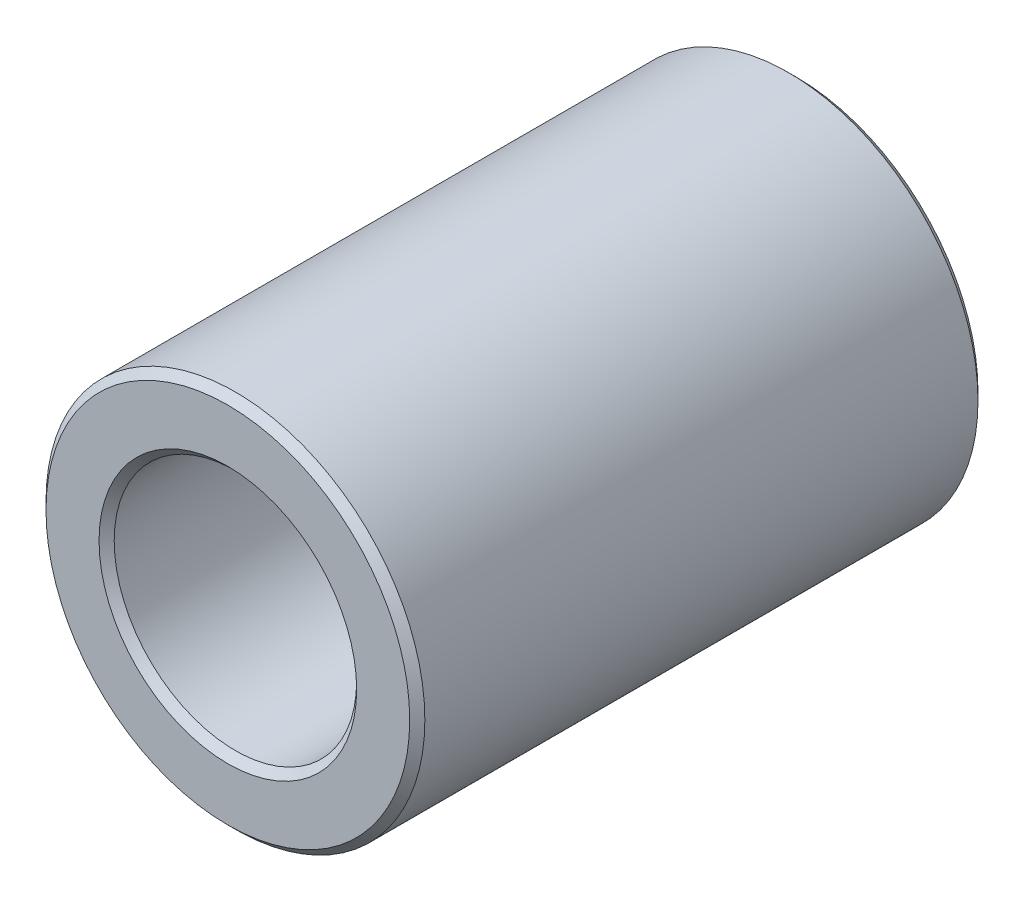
ISO-10303-21;
HEADER;
FILE_DESCRIPTION(('STEP AP214'),'2;1');
FILE_NAME('part.step','',(''),(''),'','','');
FILE_SCHEMA(('AUTOMOTIVE_DESIGN { 1 0 10303 214 1 1 1 1 }'));
ENDSEC;
DATA;
#1=APPLICATION_CONTEXT('core data for automotive mechanical design processes');
#2=APPLICATION_PROTOCOL_DEFINITION('international standard','automotive_design',2000,#1);
#3=PRODUCT_CONTEXT('',#1,'mechanical');
#4=PRODUCT('Part','Part','',(#3));
#5=PRODUCT_RELATED_PRODUCT_CATEGORY('part','',(#4));
#6=PRODUCT_DEFINITION_FORMATION('','',#4);
#7=PRODUCT_DEFINITION_CONTEXT('part definition',#1,'design');
#8=PRODUCT_DEFINITION('design','',#6,#7);
#9=PRODUCT_DEFINITION_SHAPE('','',#8);
#10=(LENGTH_UNIT() NAMED_UNIT(*) SI_UNIT(.MILLI.,.METRE.));
#11=(NAMED_UNIT(*) PLANE_ANGLE_UNIT() SI_UNIT($,.RADIAN.));
#12=(NAMED_UNIT(*) SI_UNIT($,.STERADIAN.) SOLID_ANGLE_UNIT());
#13=UNCERTAINTY_MEASURE_WITH_UNIT(LENGTH_MEASURE(1.E-05),#10,'distance_accuracy_value','');
#14=(GEOMETRIC_REPRESENTATION_CONTEXT(3) GLOBAL_UNCERTAINTY_ASSIGNED_CONTEXT((#13)) GLOBAL_UNIT_ASSIGNED_CONTEXT((#10,
#11,#12)) REPRESENTATION_CONTEXT('',''));
#15=CARTESIAN_POINT('',(0.,0.,0.));
#16=DIRECTION('',(0.,0.,1.));
#17=DIRECTION('',(1.,0.,0.));
#18=AXIS2_PLACEMENT_3D('',#15,#16,#17);
#19=CARTESIAN_POINT('',(0.,0.,7.5));
#20=DIRECTION('',(0.,0.,1.));
#21=DIRECTION('',(1.,0.,0.));
#22=AXIS2_PLACEMENT_3D('',#19,#20,#21);
#23=PLANE('',#22);
#24=CARTESIAN_POINT('',(0.,0.,7.5));
#25=DIRECTION('',(0.,0.,1.));
#26=DIRECTION('',(1.,0.,0.));
#27=AXIS2_PLACEMENT_3D('',#24,#25,#26);
#28=CIRCLE('',#27,3.4);
#29=CARTESIAN_POINT('',(3.4,0.,7.5));
#30=VERTEX_POINT('',#29);
#31=EDGE_CURVE('E10',#30,#30,#28,.F.);
#32=ORIENTED_EDGE('',*,*,#31,.T.);
#33=EDGE_LOOP('',(#32));
#34=FACE_BOUND('',#33,.T.);
#35=CARTESIAN_POINT('',(0.,0.,7.5));
#36=DIRECTION('',(0.,0.,1.));
#37=DIRECTION('',(1.,0.,0.));
#38=AXIS2_PLACEMENT_3D('',#35,#36,#37);
#39=CIRCLE('',#38,4.8);
#40=CARTESIAN_POINT('',(-4.8,0.,7.5));
#41=VERTEX_POINT('',#40);
#42=EDGE_CURVE('E45',#41,#41,#39,.T.);
#43=ORIENTED_EDGE('',*,*,#42,.T.);
#44=EDGE_LOOP('',(#43));
#45=FACE_BOUND('',#44,.T.);
#46=ADVANCED_FACE('F37',(#34,#45),#23,.T.);
#47=CARTESIAN_POINT('',(0.,0.,-7.5));
#48=DIRECTION('',(0.,0.,1.));
#49=DIRECTION('',(1.,0.,0.));
#50=AXIS2_PLACEMENT_3D('',#47,#48,#49);
#51=PLANE('',#50);
#52=CARTESIAN_POINT('',(0.,0.,-7.5));
#53=DIRECTION('',(0.,0.,1.));
#54=DIRECTION('',(1.,0.,0.));
#55=AXIS2_PLACEMENT_3D('',#52,#53,#54);
#56=CIRCLE('',#55,4.8);
#57=CARTESIAN_POINT('',(4.8,0.,-7.5));
#58=VERTEX_POINT('',#57);
#59=EDGE_CURVE('E62',#58,#58,#56,.F.);
#60=ORIENTED_EDGE('',*,*,#59,.T.);
#61=EDGE_LOOP('',(#60));
#62=FACE_BOUND('',#61,.T.);
#63=CARTESIAN_POINT('',(0.,0.,-7.5));
#64=DIRECTION('',(0.,0.,1.));
#65=DIRECTION('',(1.,0.,0.));
#66=AXIS2_PLACEMENT_3D('',#63,#64,#65);
#67=CIRCLE('',#66,3.4);
#68=CARTESIAN_POINT('',(3.4,0.,-7.5));
#69=VERTEX_POINT('',#68);
#70=EDGE_CURVE('E66',#69,#69,#67,.T.);
#71=ORIENTED_EDGE('',*,*,#70,.T.);
#72=EDGE_LOOP('',(#71));
#73=FACE_BOUND('',#72,.T.);
#74=ADVANCED_FACE('F89',(#62,#73),#51,.F.);
#75=CARTESIAN_POINT('',(0.,0.,7.5));
#76=DIRECTION('',(0.,0.,-1.));
#77=DIRECTION('',(-1.,0.,0.));
#78=AXIS2_PLACEMENT_3D('',#75,#76,#77);
#79=CYLINDRICAL_SURFACE('',#78,5.);
#80=CARTESIAN_POINT('',(0.,0.,-7.3));
#81=DIRECTION('',(0.,0.,1.));
#82=DIRECTION('',(1.,0.,0.));
#83=AXIS2_PLACEMENT_3D('',#80,#81,#82);
#84=CIRCLE('',#83,5.);
#85=CARTESIAN_POINT('',(5.,0.,-7.3));
#86=VERTEX_POINT('',#85);
#87=EDGE_CURVE('E69',#86,#86,#84,.T.);
#88=ORIENTED_EDGE('',*,*,#87,.T.);
#89=EDGE_LOOP('',(#88));
#90=FACE_BOUND('',#89,.T.);
#91=CARTESIAN_POINT('',(0.,0.,7.3));
#92=DIRECTION('',(0.,0.,1.));
#93=DIRECTION('',(1.,0.,0.));
#94=AXIS2_PLACEMENT_3D('',#91,#92,#93);
#95=CIRCLE('',#94,5.);
#96=CARTESIAN_POINT('',(-5.,0.,7.3));
#97=VERTEX_POINT('',#96);
#98=EDGE_CURVE('E73',#97,#97,#95,.F.);
#99=ORIENTED_EDGE('',*,*,#98,.T.);
#100=EDGE_LOOP('',(#99));
#101=FACE_BOUND('',#100,.T.);
#102=ADVANCED_FACE('F78',(#90,#101),#79,.T.);
#103=CARTESIAN_POINT('',(0.,0.,7.5));
#104=DIRECTION('',(0.,0.,-1.));
#105=DIRECTION('',(-1.,0.,0.));
#106=AXIS2_PLACEMENT_3D('',#103,#104,#105);
#107=CYLINDRICAL_SURFACE('',#106,3.2);
#108=CARTESIAN_POINT('',(0.,0.,-7.3));
#109=DIRECTION('',(0.,0.,1.));
#110=DIRECTION('',(1.,0.,0.));
#111=AXIS2_PLACEMENT_3D('',#108,#109,#110);
#112=CIRCLE('',#111,3.2);
#113=CARTESIAN_POINT('',(3.2,0.,-7.3));
#114=VERTEX_POINT('',#113);
#115=EDGE_CURVE('E52',#114,#114,#112,.F.);
#116=ORIENTED_EDGE('',*,*,#115,.T.);
#117=EDGE_LOOP('',(#116));
#118=FACE_BOUND('',#117,.T.);
#119=CARTESIAN_POINT('',(0.,0.,7.3));
#120=DIRECTION('',(0.,0.,1.));
#121=DIRECTION('',(1.,0.,0.));
#122=AXIS2_PLACEMENT_3D('',#119,#120,#121);
#123=CIRCLE('',#122,3.2);
#124=CARTESIAN_POINT('',(3.2,0.,7.3));
#125=VERTEX_POINT('',#124);
#126=EDGE_CURVE('E57',#125,#125,#123,.T.);
#127=ORIENTED_EDGE('',*,*,#126,.T.);
#128=EDGE_LOOP('',(#127));
#129=FACE_BOUND('',#128,.T.);
#130=ADVANCED_FACE('F97',(#118,#129),#107,.F.);
#131=CARTESIAN_POINT('',(0.,0.,-7.3));
#132=DIRECTION('',(0.,0.,1.));
#133=DIRECTION('',(1.,0.,0.));
#134=AXIS2_PLACEMENT_3D('',#131,#132,#133);
#135=CONICAL_SURFACE('',#134,5.,0.785398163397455);
#136=ORIENTED_EDGE('',*,*,#59,.F.);
#137=EDGE_LOOP('',(#136));
#138=FACE_BOUND('',#137,.T.);
#139=ORIENTED_EDGE('',*,*,#87,.F.);
#140=EDGE_LOOP('',(#139));
#141=FACE_BOUND('',#140,.T.);
#142=ADVANCED_FACE('F102',(#138,#141),#135,.T.);
#143=CARTESIAN_POINT('',(0.,0.,-7.5));
#144=DIRECTION('',(0.,0.,-1.));
#145=DIRECTION('',(-1.,0.,0.));
#146=AXIS2_PLACEMENT_3D('',#143,#144,#145);
#147=CONICAL_SURFACE('',#146,3.4,0.785398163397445);
#148=ORIENTED_EDGE('',*,*,#115,.F.);
#149=EDGE_LOOP('',(#148));
#150=FACE_BOUND('',#149,.T.);
#151=ORIENTED_EDGE('',*,*,#70,.F.);
#152=EDGE_LOOP('',(#151));
#153=FACE_BOUND('',#152,.T.);
#154=ADVANCED_FACE('F86',(#150,#153),#147,.F.);
#155=CARTESIAN_POINT('',(0.,0.,7.3));
#156=DIRECTION('',(0.,0.,1.));
#157=DIRECTION('',(1.,0.,0.));
#158=AXIS2_PLACEMENT_3D('',#155,#156,#157);
#159=CONICAL_SURFACE('',#158,3.2,0.785398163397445);
#160=ORIENTED_EDGE('',*,*,#31,.F.);
#161=EDGE_LOOP('',(#160));
#162=FACE_BOUND('',#161,.T.);
#163=ORIENTED_EDGE('',*,*,#126,.F.);
#164=EDGE_LOOP('',(#163));
#165=FACE_BOUND('',#164,.T.);
#166=ADVANCED_FACE('F82',(#162,#165),#159,.F.);
#167=CARTESIAN_POINT('',(0.,0.,7.5));
#168=DIRECTION('',(0.,0.,-1.));
#169=DIRECTION('',(-1.,0.,0.));
#170=AXIS2_PLACEMENT_3D('',#167,#168,#169);
#171=CONICAL_SURFACE('',#170,4.8,0.785398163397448);
#172=CARTESIAN_POINT('',(-5.,0.,7.3));
#173=CARTESIAN_POINT('',(-4.99791666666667,0.,7.30208333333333));
#174=CARTESIAN_POINT('',(-4.99583333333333,0.,7.30416666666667));
#175=CARTESIAN_POINT('',(-4.99166666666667,0.,7.30833333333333));
#176=CARTESIAN_POINT('',(-4.98958333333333,0.,7.31041666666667));
#177=CARTESIAN_POINT('',(-4.98541666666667,0.,7.31458333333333));
#178=CARTESIAN_POINT('',(-4.98333333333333,0.,7.31666666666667));
#179=CARTESIAN_POINT('',(-4.97916666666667,0.,7.32083333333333));
#180=CARTESIAN_POINT('',(-4.97708333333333,0.,7.32291666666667));
#181=CARTESIAN_POINT('',(-4.97291666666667,0.,7.32708333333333));
#182=CARTESIAN_POINT('',(-4.97083333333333,0.,7.32916666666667));
#183=CARTESIAN_POINT('',(-4.96666666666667,0.,7.33333333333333));
#184=CARTESIAN_POINT('',(-4.96458333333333,0.,7.33541666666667));
#185=CARTESIAN_POINT('',(-4.96041666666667,0.,7.33958333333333));
#186=CARTESIAN_POINT('',(-4.95833333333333,0.,7.34166666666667));
#187=CARTESIAN_POINT('',(-4.95416666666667,0.,7.34583333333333));
#188=CARTESIAN_POINT('',(-4.95208333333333,0.,7.34791666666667));
#189=CARTESIAN_POINT('',(-4.94791666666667,0.,7.35208333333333));
#190=CARTESIAN_POINT('',(-4.94583333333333,0.,7.35416666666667));
#191=CARTESIAN_POINT('',(-4.94166666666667,0.,7.35833333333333));
#192=CARTESIAN_POINT('',(-4.93958333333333,0.,7.36041666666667));
#193=CARTESIAN_POINT('',(-4.93541666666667,0.,7.36458333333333));
#194=CARTESIAN_POINT('',(-4.93333333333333,0.,7.36666666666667));
#195=CARTESIAN_POINT('',(-4.92916666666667,0.,7.37083333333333));
#196=CARTESIAN_POINT('',(-4.92708333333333,0.,7.37291666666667));
#197=CARTESIAN_POINT('',(-4.92291666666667,0.,7.37708333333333));
#198=CARTESIAN_POINT('',(-4.92083333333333,0.,7.37916666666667));
#199=CARTESIAN_POINT('',(-4.91666666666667,0.,7.38333333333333));
#200=CARTESIAN_POINT('',(-4.91458333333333,0.,7.38541666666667));
#201=CARTESIAN_POINT('',(-4.91041666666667,0.,7.38958333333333));
#202=CARTESIAN_POINT('',(-4.90833333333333,0.,7.39166666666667));
#203=CARTESIAN_POINT('',(-4.90416666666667,0.,7.39583333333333));
#204=CARTESIAN_POINT('',(-4.90208333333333,0.,7.39791666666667));
#205=CARTESIAN_POINT('',(-4.89791666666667,0.,7.40208333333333));
#206=CARTESIAN_POINT('',(-4.89583333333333,0.,7.40416666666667));
#207=CARTESIAN_POINT('',(-4.89166666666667,0.,7.40833333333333));
#208=CARTESIAN_POINT('',(-4.88958333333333,0.,7.41041666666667));
#209=CARTESIAN_POINT('',(-4.88541666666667,0.,7.41458333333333));
#210=CARTESIAN_POINT('',(-4.88333333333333,0.,7.41666666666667));
#211=CARTESIAN_POINT('',(-4.87916666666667,0.,7.42083333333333));
#212=CARTESIAN_POINT('',(-4.87708333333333,0.,7.42291666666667));
#213=CARTESIAN_POINT('',(-4.87291666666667,0.,7.42708333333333));
#214=CARTESIAN_POINT('',(-4.87083333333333,0.,7.42916666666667));
#215=CARTESIAN_POINT('',(-4.86666666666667,0.,7.43333333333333));
#216=CARTESIAN_POINT('',(-4.86458333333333,0.,7.43541666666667));
#217=CARTESIAN_POINT('',(-4.86041666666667,0.,7.43958333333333));
#218=CARTESIAN_POINT('',(-4.85833333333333,0.,7.44166666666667));
#219=CARTESIAN_POINT('',(-4.85416666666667,0.,7.44583333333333));
#220=CARTESIAN_POINT('',(-4.85208333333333,0.,7.44791666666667));
#221=CARTESIAN_POINT('',(-4.84791666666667,0.,7.45208333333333));
#222=CARTESIAN_POINT('',(-4.84583333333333,0.,7.45416666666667));
#223=CARTESIAN_POINT('',(-4.84166666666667,0.,7.45833333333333));
#224=CARTESIAN_POINT('',(-4.83958333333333,0.,7.46041666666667));
#225=CARTESIAN_POINT('',(-4.83541666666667,0.,7.46458333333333));
#226=CARTESIAN_POINT('',(-4.83333333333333,0.,7.46666666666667));
#227=CARTESIAN_POINT('',(-4.82916666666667,0.,7.47083333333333));
#228=CARTESIAN_POINT('',(-4.82708333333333,0.,7.47291666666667));
#229=CARTESIAN_POINT('',(-4.82291666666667,0.,7.47708333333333));
#230=CARTESIAN_POINT('',(-4.82083333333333,0.,7.47916666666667));
#231=CARTESIAN_POINT('',(-4.81666666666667,0.,7.48333333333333));
#232=CARTESIAN_POINT('',(-4.81458333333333,0.,7.48541666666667));
#233=CARTESIAN_POINT('',(-4.81041666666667,0.,7.48958333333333));
#234=CARTESIAN_POINT('',(-4.80833333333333,0.,7.49166666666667));
#235=CARTESIAN_POINT('',(-4.80416666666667,0.,7.49583333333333));
#236=CARTESIAN_POINT('',(-4.80208333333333,0.,7.49791666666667));
#237=CARTESIAN_POINT('',(-4.8,0.,7.5));
#238=B_SPLINE_CURVE_WITH_KNOTS('',3,(#172,#173,#174,#175,#176,#177,#178,#179,#180,#181,#182,
#183,#184,#185,#186,#187,#188,#189,#190,#191,#192,#193,#194,#195,#196,#197,#198,#199,#200,#201,
#202,#203,#204,#205,#206,#207,#208,#209,#210,#211,#212,#213,#214,#215,#216,#217,#218,#219,#220,
#221,#222,#223,#224,#225,#226,#227,#228,#229,#230,#231,#232,#233,#234,#235,#236,#237),
.UNSPECIFIED.,.F.,.F.,(4,2,2,2,2,2,2,2,2,2,2,2,2,2,2,2,2,2,2,2,2,2,2,2,2,2,2,2,2,2,2,2,4),(0.,
0.00883883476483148,0.0176776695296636,0.0265165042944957,0.0353553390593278,0.0441941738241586,
0.0530330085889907,0.0618718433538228,0.0707106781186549,0.0795495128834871,0.0883883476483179,
0.09722718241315,0.106066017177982,0.114904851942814,0.123743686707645,0.132582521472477,
0.141421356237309,0.150260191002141,0.159099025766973,0.167937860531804,0.176776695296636,
0.185615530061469,0.194454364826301,0.203293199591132,0.212132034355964,0.220970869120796,
0.229809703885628,0.23864853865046,0.247487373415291,0.256326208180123,0.265165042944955,
0.274003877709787,0.282842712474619),.UNSPECIFIED.);
#239=EDGE_CURVE('BSEAM39',#97,#41,#238,.T.);
#240=ORIENTED_EDGE('',*,*,#98,.F.);
#241=ORIENTED_EDGE('',*,*,#42,.F.);
#242=ORIENTED_EDGE('',*,*,#239,.T.);
#243=ORIENTED_EDGE('',*,*,#239,.F.);
#244=EDGE_LOOP('',(#240,#242,#241,#243));
#245=FACE_BOUND('',#244,.T.);
#246=ADVANCED_FACE('F39',(#245),#171,.T.);
#247=CLOSED_SHELL('',(#46,#74,#102,#130,#142,#154,#166,#246));
#248=MANIFOLD_SOLID_BREP('B2',#247);
#249=ADVANCED_BREP_SHAPE_REPRESENTATION('',(#18,#248),#14);
#250=SHAPE_DEFINITION_REPRESENTATION(#9,#249);
ENDSEC;
END-ISO-10303-21;
